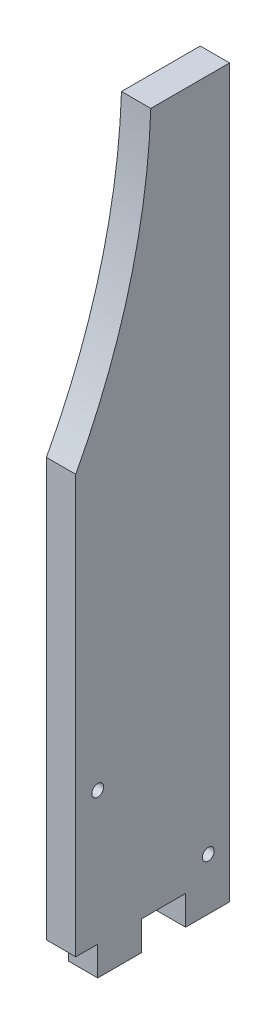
ISO-10303-21;
HEADER;
FILE_DESCRIPTION(('STEP AP214'),'2;1');
FILE_NAME('part.step','',(''),(''),'','','');
FILE_SCHEMA(('AUTOMOTIVE_DESIGN { 1 0 10303 214 1 1 1 1 }'));
ENDSEC;
DATA;
#1=APPLICATION_CONTEXT('core data for automotive mechanical design processes');
#2=APPLICATION_PROTOCOL_DEFINITION('international standard','automotive_design',2000,#1);
#3=PRODUCT_CONTEXT('',#1,'mechanical');
#4=PRODUCT('Part','Part','',(#3));
#5=PRODUCT_RELATED_PRODUCT_CATEGORY('part','',(#4));
#6=PRODUCT_DEFINITION_FORMATION('','',#4);
#7=PRODUCT_DEFINITION_CONTEXT('part definition',#1,'design');
#8=PRODUCT_DEFINITION('design','',#6,#7);
#9=PRODUCT_DEFINITION_SHAPE('','',#8);
#10=(LENGTH_UNIT() NAMED_UNIT(*) SI_UNIT(.MILLI.,.METRE.));
#11=(NAMED_UNIT(*) PLANE_ANGLE_UNIT() SI_UNIT($,.RADIAN.));
#12=(NAMED_UNIT(*) SI_UNIT($,.STERADIAN.) SOLID_ANGLE_UNIT());
#13=UNCERTAINTY_MEASURE_WITH_UNIT(LENGTH_MEASURE(1.E-05),#10,'distance_accuracy_value','');
#14=(GEOMETRIC_REPRESENTATION_CONTEXT(3) GLOBAL_UNCERTAINTY_ASSIGNED_CONTEXT((#13)) GLOBAL_UNIT_ASSIGNED_CONTEXT((#10,
#11,#12)) REPRESENTATION_CONTEXT('',''));
#15=CARTESIAN_POINT('',(0.,0.,0.));
#16=DIRECTION('',(0.,0.,1.));
#17=DIRECTION('',(1.,0.,0.));
#18=AXIS2_PLACEMENT_3D('',#15,#16,#17);
#19=CARTESIAN_POINT('',(20.,490.917508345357,384.999999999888));
#20=DIRECTION('',(1.,0.,0.));
#21=DIRECTION('',(0.,0.,-1.));
#22=AXIS2_PLACEMENT_3D('',#19,#20,#21);
#23=PLANE('',#22);
#24=CARTESIAN_POINT('',(20.,90.9175083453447,-15.0000000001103));
#25=DIRECTION('',(1.,0.,0.));
#26=DIRECTION('',(0.,0.,-1.));
#27=AXIS2_PLACEMENT_3D('',#24,#25,#26);
#28=CIRCLE('',#27,4.05000000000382);
#29=CARTESIAN_POINT('',(20.,90.9175083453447,-19.0500000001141));
#30=VERTEX_POINT('',#29);
#31=EDGE_CURVE('E151',#30,#30,#28,.T.);
#32=ORIENTED_EDGE('',*,*,#31,.F.);
#33=EDGE_LOOP('',(#32));
#34=FACE_BOUND('',#33,.T.);
#35=DIRECTION('',(0.,-1.,0.));
#36=VECTOR('',#35,1.);
#37=CARTESIAN_POINT('',(20.,0.,-15.0000000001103));
#38=LINE('',#37,#36);
#39=CARTESIAN_POINT('',(20.,0.,-15.0000000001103));
#40=VERTEX_POINT('',#39);
#41=CARTESIAN_POINT('',(20.,-20.,-15.0000000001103));
#42=VERTEX_POINT('',#41);
#43=EDGE_CURVE('E169',#40,#42,#38,.T.);
#44=ORIENTED_EDGE('',*,*,#43,.T.);
#45=DIRECTION('',(0.,0.,-1.));
#46=VECTOR('',#45,1.);
#47=CARTESIAN_POINT('',(20.,-20.,-15.0000000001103));
#48=LINE('',#47,#46);
#49=CARTESIAN_POINT('',(20.,-20.,-45.0000000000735));
#50=VERTEX_POINT('',#49);
#51=EDGE_CURVE('E101',#42,#50,#48,.T.);
#52=ORIENTED_EDGE('',*,*,#51,.T.);
#53=DIRECTION('',(0.,1.,0.));
#54=VECTOR('',#53,1.);
#55=CARTESIAN_POINT('',(20.,-20.,-45.0000000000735));
#56=LINE('',#55,#54);
#57=CARTESIAN_POINT('',(20.,0.,-45.0000000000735));
#58=VERTEX_POINT('',#57);
#59=EDGE_CURVE('E193',#50,#58,#56,.T.);
#60=ORIENTED_EDGE('',*,*,#59,.T.);
#61=DIRECTION('',(0.,0.,-1.));
#62=VECTOR('',#61,1.);
#63=CARTESIAN_POINT('',(20.,0.,-45.0000000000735));
#64=LINE('',#63,#62);
#65=CARTESIAN_POINT('',(20.,0.,-75.0000000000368));
#66=VERTEX_POINT('',#65);
#67=EDGE_CURVE('E212',#58,#66,#64,.T.);
#68=ORIENTED_EDGE('',*,*,#67,.T.);
#69=DIRECTION('',(0.,-1.,0.));
#70=VECTOR('',#69,1.);
#71=CARTESIAN_POINT('',(20.,0.,-75.0000000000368));
#72=LINE('',#71,#70);
#73=CARTESIAN_POINT('',(20.,-20.,-75.0000000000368));
#74=VERTEX_POINT('',#73);
#75=EDGE_CURVE('E209',#66,#74,#72,.T.);
#76=ORIENTED_EDGE('',*,*,#75,.T.);
#77=DIRECTION('',(0.,0.,-1.));
#78=VECTOR('',#77,1.);
#79=CARTESIAN_POINT('',(20.,-20.,-75.0000000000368));
#80=LINE('',#79,#78);
#81=CARTESIAN_POINT('',(20.,-20.,-105.));
#82=VERTEX_POINT('',#81);
#83=EDGE_CURVE('E211',#74,#82,#80,.T.);
#84=ORIENTED_EDGE('',*,*,#83,.T.);
#85=DIRECTION('',(0.,1.,0.));
#86=VECTOR('',#85,1.);
#87=CARTESIAN_POINT('',(20.,-20.,-105.));
#88=LINE('',#87,#86);
#89=CARTESIAN_POINT('',(20.,475.917508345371,-105.));
#90=VERTEX_POINT('',#89);
#91=EDGE_CURVE('E214',#82,#90,#88,.T.);
#92=ORIENTED_EDGE('',*,*,#91,.T.);
#93=DIRECTION('',(0.,-1.09437923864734E-13,1.));
#94=VECTOR('',#93,1.);
#95=CARTESIAN_POINT('',(20.,475.917508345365,-51.2326968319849));
#96=LINE('',#95,#94);
#97=CARTESIAN_POINT('',(20.,475.917508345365,-51.2326968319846));
#98=VERTEX_POINT('',#97);
#99=EDGE_CURVE('E129',#90,#98,#96,.T.);
#100=ORIENTED_EDGE('',*,*,#99,.T.);
#101=CARTESIAN_POINT('',(20.,490.917508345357,384.999999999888));
#102=DIRECTION('',(-1.,0.,0.));
#103=DIRECTION('',(0.,0.,-1.));
#104=AXIS2_PLACEMENT_3D('',#101,#102,#103);
#105=CIRCLE('',#104,436.490510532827);
#106=CARTESIAN_POINT('',(20.,285.250384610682,0.));
#107=VERTEX_POINT('',#106);
#108=EDGE_CURVE('E123',#98,#107,#105,.T.);
#109=ORIENTED_EDGE('',*,*,#108,.T.);
#110=DIRECTION('',(0.,-1.,0.));
#111=VECTOR('',#110,1.);
#112=CARTESIAN_POINT('',(20.,0.,0.));
#113=LINE('',#112,#111);
#114=CARTESIAN_POINT('',(20.,0.,0.));
#115=VERTEX_POINT('',#114);
#116=EDGE_CURVE('E127',#107,#115,#113,.T.);
#117=ORIENTED_EDGE('',*,*,#116,.T.);
#118=DIRECTION('',(0.,0.,-1.));
#119=VECTOR('',#118,1.);
#120=CARTESIAN_POINT('',(20.,0.,0.));
#121=LINE('',#120,#119);
#122=EDGE_CURVE('E49',#115,#40,#121,.T.);
#123=ORIENTED_EDGE('',*,*,#122,.T.);
#124=EDGE_LOOP('',(#44,#52,#60,#68,#76,#84,#92,#100,#109,#117,#123));
#125=FACE_BOUND('',#124,.T.);
#126=CARTESIAN_POINT('',(20.,15.4211905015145,-90.496317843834));
#127=DIRECTION('',(1.,0.,0.));
#128=DIRECTION('',(0.,0.,-1.));
#129=AXIS2_PLACEMENT_3D('',#126,#127,#128);
#130=CIRCLE('',#129,4.05000000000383);
#131=CARTESIAN_POINT('',(20.,15.4211905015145,-94.5463178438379));
#132=VERTEX_POINT('',#131);
#133=EDGE_CURVE('E259',#132,#132,#130,.T.);
#134=ORIENTED_EDGE('',*,*,#133,.F.);
#135=EDGE_LOOP('',(#134));
#136=FACE_BOUND('',#135,.T.);
#137=ADVANCED_FACE('F32',(#34,#125,#136),#23,.T.);
#138=CARTESIAN_POINT('',(0.,490.917508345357,384.999999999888));
#139=DIRECTION('',(1.,0.,0.));
#140=DIRECTION('',(0.,0.,-1.));
#141=AXIS2_PLACEMENT_3D('',#138,#139,#140);
#142=PLANE('',#141);
#143=CARTESIAN_POINT('',(0.,90.9175083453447,-15.0000000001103));
#144=DIRECTION('',(1.,0.,0.));
#145=DIRECTION('',(0.,0.,-1.));
#146=AXIS2_PLACEMENT_3D('',#143,#144,#145);
#147=CIRCLE('',#146,4.05000000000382);
#148=CARTESIAN_POINT('',(0.,90.9175083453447,-19.0500000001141));
#149=VERTEX_POINT('',#148);
#150=EDGE_CURVE('E264',#149,#149,#147,.T.);
#151=ORIENTED_EDGE('',*,*,#150,.T.);
#152=EDGE_LOOP('',(#151));
#153=FACE_BOUND('',#152,.T.);
#154=DIRECTION('',(0.,-1.,0.));
#155=VECTOR('',#154,1.);
#156=CARTESIAN_POINT('',(0.,0.,-15.0000000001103));
#157=LINE('',#156,#155);
#158=CARTESIAN_POINT('',(0.,0.,-15.0000000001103));
#159=VERTEX_POINT('',#158);
#160=CARTESIAN_POINT('',(0.,-20.,-15.0000000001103));
#161=VERTEX_POINT('',#160);
#162=EDGE_CURVE('E147',#159,#161,#157,.T.);
#163=ORIENTED_EDGE('',*,*,#162,.F.);
#164=DIRECTION('',(0.,0.,-1.));
#165=VECTOR('',#164,1.);
#166=CARTESIAN_POINT('',(0.,0.,0.));
#167=LINE('',#166,#165);
#168=CARTESIAN_POINT('',(0.,0.,0.));
#169=VERTEX_POINT('',#168);
#170=EDGE_CURVE('E93',#169,#159,#167,.T.);
#171=ORIENTED_EDGE('',*,*,#170,.F.);
#172=DIRECTION('',(0.,-1.,0.));
#173=VECTOR('',#172,1.);
#174=CARTESIAN_POINT('',(0.,0.,0.));
#175=LINE('',#174,#173);
#176=CARTESIAN_POINT('',(0.,285.250384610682,0.));
#177=VERTEX_POINT('',#176);
#178=EDGE_CURVE('E87',#177,#169,#175,.T.);
#179=ORIENTED_EDGE('',*,*,#178,.F.);
#180=CARTESIAN_POINT('',(0.,490.917508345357,384.999999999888));
#181=DIRECTION('',(-1.,0.,0.));
#182=DIRECTION('',(0.,0.,-1.));
#183=AXIS2_PLACEMENT_3D('',#180,#181,#182);
#184=CIRCLE('',#183,436.490510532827);
#185=CARTESIAN_POINT('',(0.,475.917508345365,-51.2326968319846));
#186=VERTEX_POINT('',#185);
#187=EDGE_CURVE('E137',#186,#177,#184,.T.);
#188=ORIENTED_EDGE('',*,*,#187,.F.);
#189=DIRECTION('',(0.,-1.09437923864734E-13,1.));
#190=VECTOR('',#189,1.);
#191=CARTESIAN_POINT('',(0.,475.917508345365,-51.2326968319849));
#192=LINE('',#191,#190);
#193=CARTESIAN_POINT('',(0.,475.917508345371,-105.));
#194=VERTEX_POINT('',#193);
#195=EDGE_CURVE('E164',#194,#186,#192,.T.);
#196=ORIENTED_EDGE('',*,*,#195,.F.);
#197=DIRECTION('',(0.,1.,0.));
#198=VECTOR('',#197,1.);
#199=CARTESIAN_POINT('',(0.,0.,-105.));
#200=LINE('',#199,#198);
#201=CARTESIAN_POINT('',(0.,-20.,-105.));
#202=VERTEX_POINT('',#201);
#203=EDGE_CURVE('E162',#202,#194,#200,.T.);
#204=ORIENTED_EDGE('',*,*,#203,.F.);
#205=DIRECTION('',(0.,0.,-1.));
#206=VECTOR('',#205,1.);
#207=CARTESIAN_POINT('',(0.,-20.,-75.0000000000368));
#208=LINE('',#207,#206);
#209=CARTESIAN_POINT('',(0.,-20.,-75.0000000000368));
#210=VERTEX_POINT('',#209);
#211=EDGE_CURVE('E159',#210,#202,#208,.T.);
#212=ORIENTED_EDGE('',*,*,#211,.F.);
#213=DIRECTION('',(0.,-1.,0.));
#214=VECTOR('',#213,1.);
#215=CARTESIAN_POINT('',(0.,0.,-75.0000000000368));
#216=LINE('',#215,#214);
#217=CARTESIAN_POINT('',(0.,0.,-75.0000000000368));
#218=VERTEX_POINT('',#217);
#219=EDGE_CURVE('E157',#218,#210,#216,.T.);
#220=ORIENTED_EDGE('',*,*,#219,.F.);
#221=DIRECTION('',(0.,0.,-1.));
#222=VECTOR('',#221,1.);
#223=CARTESIAN_POINT('',(0.,0.,-45.0000000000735));
#224=LINE('',#223,#222);
#225=CARTESIAN_POINT('',(0.,0.,-45.0000000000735));
#226=VERTEX_POINT('',#225);
#227=EDGE_CURVE('E155',#226,#218,#224,.T.);
#228=ORIENTED_EDGE('',*,*,#227,.F.);
#229=DIRECTION('',(0.,1.,0.));
#230=VECTOR('',#229,1.);
#231=CARTESIAN_POINT('',(0.,-20.,-45.0000000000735));
#232=LINE('',#231,#230);
#233=CARTESIAN_POINT('',(0.,-20.,-45.0000000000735));
#234=VERTEX_POINT('',#233);
#235=EDGE_CURVE('E153',#234,#226,#232,.T.);
#236=ORIENTED_EDGE('',*,*,#235,.F.);
#237=DIRECTION('',(0.,0.,-1.));
#238=VECTOR('',#237,1.);
#239=CARTESIAN_POINT('',(0.,-20.,-15.0000000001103));
#240=LINE('',#239,#238);
#241=EDGE_CURVE('E150',#161,#234,#240,.T.);
#242=ORIENTED_EDGE('',*,*,#241,.F.);
#243=EDGE_LOOP('',(#163,#171,#179,#188,#196,#204,#212,#220,#228,#236,#242));
#244=FACE_BOUND('',#243,.T.);
#245=CARTESIAN_POINT('',(0.,15.4211905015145,-90.496317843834));
#246=DIRECTION('',(1.,0.,0.));
#247=DIRECTION('',(0.,0.,-1.));
#248=AXIS2_PLACEMENT_3D('',#245,#246,#247);
#249=CIRCLE('',#248,4.05000000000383);
#250=CARTESIAN_POINT('',(0.,15.4211905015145,-94.5463178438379));
#251=VERTEX_POINT('',#250);
#252=EDGE_CURVE('E262',#251,#251,#249,.T.);
#253=ORIENTED_EDGE('',*,*,#252,.T.);
#254=EDGE_LOOP('',(#253));
#255=FACE_BOUND('',#254,.T.);
#256=ADVANCED_FACE('F197',(#153,#244,#255),#142,.F.);
#257=CARTESIAN_POINT('',(20.,0.,-15.0000000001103));
#258=DIRECTION('',(0.,0.,-1.));
#259=DIRECTION('',(0.,1.,0.));
#260=AXIS2_PLACEMENT_3D('',#257,#258,#259);
#261=PLANE('',#260);
#262=ORIENTED_EDGE('',*,*,#162,.T.);
#263=DIRECTION('',(-1.,0.,0.));
#264=VECTOR('',#263,1.);
#265=CARTESIAN_POINT('',(20.,-20.,-15.0000000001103));
#266=LINE('',#265,#264);
#267=EDGE_CURVE('E11',#42,#161,#266,.T.);
#268=ORIENTED_EDGE('',*,*,#267,.F.);
#269=ORIENTED_EDGE('',*,*,#43,.F.);
#270=DIRECTION('',(-1.,0.,0.));
#271=VECTOR('',#270,1.);
#272=CARTESIAN_POINT('',(20.,0.,-15.0000000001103));
#273=LINE('',#272,#271);
#274=EDGE_CURVE('E143',#40,#159,#273,.T.);
#275=ORIENTED_EDGE('',*,*,#274,.T.);
#276=EDGE_LOOP('',(#262,#268,#269,#275));
#277=FACE_BOUND('',#276,.T.);
#278=ADVANCED_FACE('F34',(#277),#261,.F.);
#279=CARTESIAN_POINT('',(20.,-20.,-15.0000000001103));
#280=DIRECTION('',(0.,1.,0.));
#281=DIRECTION('',(0.,0.,1.));
#282=AXIS2_PLACEMENT_3D('',#279,#280,#281);
#283=PLANE('',#282);
#284=ORIENTED_EDGE('',*,*,#241,.T.);
#285=DIRECTION('',(-1.,0.,0.));
#286=VECTOR('',#285,1.);
#287=CARTESIAN_POINT('',(20.,-20.,-45.0000000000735));
#288=LINE('',#287,#286);
#289=EDGE_CURVE('E41',#50,#234,#288,.T.);
#290=ORIENTED_EDGE('',*,*,#289,.F.);
#291=ORIENTED_EDGE('',*,*,#51,.F.);
#292=ORIENTED_EDGE('',*,*,#267,.T.);
#293=EDGE_LOOP('',(#284,#290,#291,#292));
#294=FACE_BOUND('',#293,.T.);
#295=ADVANCED_FACE('F348',(#294),#283,.F.);
#296=CARTESIAN_POINT('',(20.,-20.,-45.0000000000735));
#297=DIRECTION('',(0.,0.,1.));
#298=DIRECTION('',(1.,0.,0.));
#299=AXIS2_PLACEMENT_3D('',#296,#297,#298);
#300=PLANE('',#299);
#301=ORIENTED_EDGE('',*,*,#235,.T.);
#302=DIRECTION('',(-1.,0.,0.));
#303=VECTOR('',#302,1.);
#304=CARTESIAN_POINT('',(20.,0.,-45.0000000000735));
#305=LINE('',#304,#303);
#306=EDGE_CURVE('E185',#58,#226,#305,.T.);
#307=ORIENTED_EDGE('',*,*,#306,.F.);
#308=ORIENTED_EDGE('',*,*,#59,.F.);
#309=ORIENTED_EDGE('',*,*,#289,.T.);
#310=EDGE_LOOP('',(#301,#307,#308,#309));
#311=FACE_BOUND('',#310,.T.);
#312=ADVANCED_FACE('F191',(#311),#300,.F.);
#313=CARTESIAN_POINT('',(20.,0.,-45.0000000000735));
#314=DIRECTION('',(0.,1.,0.));
#315=DIRECTION('',(0.,0.,1.));
#316=AXIS2_PLACEMENT_3D('',#313,#314,#315);
#317=PLANE('',#316);
#318=ORIENTED_EDGE('',*,*,#227,.T.);
#319=DIRECTION('',(-1.,0.,0.));
#320=VECTOR('',#319,1.);
#321=CARTESIAN_POINT('',(20.,0.,-75.0000000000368));
#322=LINE('',#321,#320);
#323=EDGE_CURVE('E182',#66,#218,#322,.T.);
#324=ORIENTED_EDGE('',*,*,#323,.F.);
#325=ORIENTED_EDGE('',*,*,#67,.F.);
#326=ORIENTED_EDGE('',*,*,#306,.T.);
#327=EDGE_LOOP('',(#318,#324,#325,#326));
#328=FACE_BOUND('',#327,.T.);
#329=ADVANCED_FACE('F203',(#328),#317,.F.);
#330=CARTESIAN_POINT('',(20.,0.,-75.0000000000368));
#331=DIRECTION('',(0.,0.,-1.));
#332=DIRECTION('',(-1.,0.,0.));
#333=AXIS2_PLACEMENT_3D('',#330,#331,#332);
#334=PLANE('',#333);
#335=ORIENTED_EDGE('',*,*,#219,.T.);
#336=DIRECTION('',(-1.,0.,0.));
#337=VECTOR('',#336,1.);
#338=CARTESIAN_POINT('',(20.,-20.,-75.0000000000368));
#339=LINE('',#338,#337);
#340=EDGE_CURVE('E179',#74,#210,#339,.T.);
#341=ORIENTED_EDGE('',*,*,#340,.F.);
#342=ORIENTED_EDGE('',*,*,#75,.F.);
#343=ORIENTED_EDGE('',*,*,#323,.T.);
#344=EDGE_LOOP('',(#335,#341,#342,#343));
#345=FACE_BOUND('',#344,.T.);
#346=ADVANCED_FACE('F207',(#345),#334,.F.);
#347=CARTESIAN_POINT('',(20.,-20.,-75.0000000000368));
#348=DIRECTION('',(0.,1.,0.));
#349=DIRECTION('',(0.,0.,1.));
#350=AXIS2_PLACEMENT_3D('',#347,#348,#349);
#351=PLANE('',#350);
#352=ORIENTED_EDGE('',*,*,#211,.T.);
#353=DIRECTION('',(-1.,0.,0.));
#354=VECTOR('',#353,1.);
#355=CARTESIAN_POINT('',(20.,-20.,-105.));
#356=LINE('',#355,#354);
#357=EDGE_CURVE('E176',#82,#202,#356,.T.);
#358=ORIENTED_EDGE('',*,*,#357,.F.);
#359=ORIENTED_EDGE('',*,*,#83,.F.);
#360=ORIENTED_EDGE('',*,*,#340,.T.);
#361=EDGE_LOOP('',(#352,#358,#359,#360));
#362=FACE_BOUND('',#361,.T.);
#363=ADVANCED_FACE('F313',(#362),#351,.F.);
#364=CARTESIAN_POINT('',(20.,0.,-105.));
#365=DIRECTION('',(0.,0.,1.));
#366=DIRECTION('',(1.,0.,0.));
#367=AXIS2_PLACEMENT_3D('',#364,#365,#366);
#368=PLANE('',#367);
#369=ORIENTED_EDGE('',*,*,#203,.T.);
#370=DIRECTION('',(-1.,0.,0.));
#371=VECTOR('',#370,1.);
#372=CARTESIAN_POINT('',(20.,475.917508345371,-105.));
#373=LINE('',#372,#371);
#374=EDGE_CURVE('E173',#90,#194,#373,.T.);
#375=ORIENTED_EDGE('',*,*,#374,.F.);
#376=ORIENTED_EDGE('',*,*,#91,.F.);
#377=ORIENTED_EDGE('',*,*,#357,.T.);
#378=EDGE_LOOP('',(#369,#375,#376,#377));
#379=FACE_BOUND('',#378,.T.);
#380=ADVANCED_FACE('F223',(#379),#368,.F.);
#381=CARTESIAN_POINT('',(20.,475.917508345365,-51.2326968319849));
#382=DIRECTION('',(0.,-1.,-1.09437923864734E-13));
#383=DIRECTION('',(0.,1.09437923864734E-13,-1.));
#384=AXIS2_PLACEMENT_3D('',#381,#382,#383);
#385=PLANE('',#384);
#386=ORIENTED_EDGE('',*,*,#195,.T.);
#387=DIRECTION('',(-1.,0.,0.));
#388=VECTOR('',#387,1.);
#389=CARTESIAN_POINT('',(20.,475.917508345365,-51.2326968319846));
#390=LINE('',#389,#388);
#391=EDGE_CURVE('E138',#98,#186,#390,.T.);
#392=ORIENTED_EDGE('',*,*,#391,.F.);
#393=ORIENTED_EDGE('',*,*,#99,.F.);
#394=ORIENTED_EDGE('',*,*,#374,.T.);
#395=EDGE_LOOP('',(#386,#392,#393,#394));
#396=FACE_BOUND('',#395,.T.);
#397=ADVANCED_FACE('F226',(#396),#385,.F.);
#398=CARTESIAN_POINT('',(20.,490.917508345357,384.999999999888));
#399=DIRECTION('',(-1.,0.,0.));
#400=DIRECTION('',(0.,0.,1.));
#401=AXIS2_PLACEMENT_3D('',#398,#399,#400);
#402=CYLINDRICAL_SURFACE('',#401,436.490510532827);
#403=ORIENTED_EDGE('',*,*,#187,.T.);
#404=DIRECTION('',(-1.,0.,0.));
#405=VECTOR('',#404,1.);
#406=CARTESIAN_POINT('',(20.,285.250384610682,0.));
#407=LINE('',#406,#405);
#408=EDGE_CURVE('E134',#107,#177,#407,.T.);
#409=ORIENTED_EDGE('',*,*,#408,.F.);
#410=ORIENTED_EDGE('',*,*,#108,.F.);
#411=ORIENTED_EDGE('',*,*,#391,.T.);
#412=EDGE_LOOP('',(#403,#409,#410,#411));
#413=FACE_BOUND('',#412,.T.);
#414=ADVANCED_FACE('F135',(#413),#402,.F.);
#415=CARTESIAN_POINT('',(20.,0.,0.));
#416=DIRECTION('',(0.,0.,-1.));
#417=DIRECTION('',(-1.,0.,0.));
#418=AXIS2_PLACEMENT_3D('',#415,#416,#417);
#419=PLANE('',#418);
#420=ORIENTED_EDGE('',*,*,#178,.T.);
#421=DIRECTION('',(-1.,0.,0.));
#422=VECTOR('',#421,1.);
#423=CARTESIAN_POINT('',(20.,0.,0.));
#424=LINE('',#423,#422);
#425=EDGE_CURVE('E139',#115,#169,#424,.T.);
#426=ORIENTED_EDGE('',*,*,#425,.F.);
#427=ORIENTED_EDGE('',*,*,#116,.F.);
#428=ORIENTED_EDGE('',*,*,#408,.T.);
#429=EDGE_LOOP('',(#420,#426,#427,#428));
#430=FACE_BOUND('',#429,.T.);
#431=ADVANCED_FACE('F141',(#430),#419,.F.);
#432=CARTESIAN_POINT('',(20.,0.,0.));
#433=DIRECTION('',(0.,1.,0.));
#434=DIRECTION('',(0.,0.,1.));
#435=AXIS2_PLACEMENT_3D('',#432,#433,#434);
#436=PLANE('',#435);
#437=ORIENTED_EDGE('',*,*,#170,.T.);
#438=ORIENTED_EDGE('',*,*,#274,.F.);
#439=ORIENTED_EDGE('',*,*,#122,.F.);
#440=ORIENTED_EDGE('',*,*,#425,.T.);
#441=EDGE_LOOP('',(#437,#438,#439,#440));
#442=FACE_BOUND('',#441,.T.);
#443=ADVANCED_FACE('F230',(#442),#436,.F.);
#444=CARTESIAN_POINT('',(20.,90.9175083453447,-15.0000000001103));
#445=DIRECTION('',(-1.,0.,0.));
#446=DIRECTION('',(0.,0.,1.));
#447=AXIS2_PLACEMENT_3D('',#444,#445,#446);
#448=CYLINDRICAL_SURFACE('',#447,4.05000000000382);
#449=ORIENTED_EDGE('',*,*,#31,.T.);
#450=EDGE_LOOP('',(#449));
#451=FACE_BOUND('',#450,.T.);
#452=ORIENTED_EDGE('',*,*,#150,.F.);
#453=EDGE_LOOP('',(#452));
#454=FACE_BOUND('',#453,.T.);
#455=ADVANCED_FACE('F232',(#451,#454),#448,.F.);
#456=CARTESIAN_POINT('',(20.,15.4211905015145,-90.496317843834));
#457=DIRECTION('',(-1.,0.,0.));
#458=DIRECTION('',(0.,0.,1.));
#459=AXIS2_PLACEMENT_3D('',#456,#457,#458);
#460=CYLINDRICAL_SURFACE('',#459,4.05000000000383);
#461=ORIENTED_EDGE('',*,*,#133,.T.);
#462=EDGE_LOOP('',(#461));
#463=FACE_BOUND('',#462,.T.);
#464=ORIENTED_EDGE('',*,*,#252,.F.);
#465=EDGE_LOOP('',(#464));
#466=FACE_BOUND('',#465,.T.);
#467=ADVANCED_FACE('F238',(#463,#466),#460,.F.);
#468=CLOSED_SHELL('',(#137,#256,#278,#295,#312,#329,#346,#363,#380,#397,#414,#431,#443,#455,#467));
#469=MANIFOLD_SOLID_BREP('B2',#468);
#470=ADVANCED_BREP_SHAPE_REPRESENTATION('',(#18,#469),#14);
#471=SHAPE_DEFINITION_REPRESENTATION(#9,#470);
ENDSEC;
END-ISO-10303-21;
